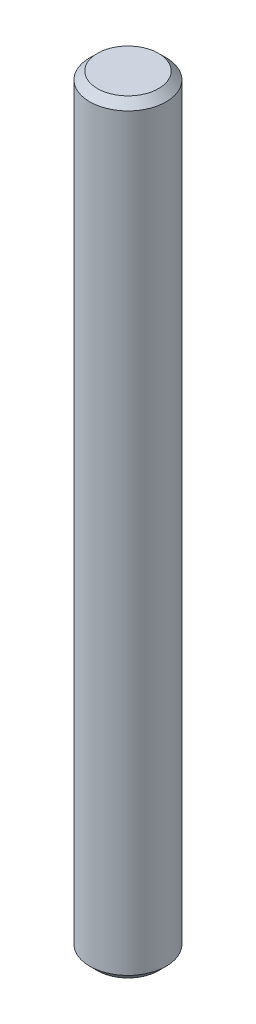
ISO-10303-21;
HEADER;
FILE_DESCRIPTION(('STEP AP214'),'2;1');
FILE_NAME('part.step','',(''),(''),'','','');
FILE_SCHEMA(('AUTOMOTIVE_DESIGN { 1 0 10303 214 1 1 1 1 }'));
ENDSEC;
DATA;
#1=APPLICATION_CONTEXT('core data for automotive mechanical design processes');
#2=APPLICATION_PROTOCOL_DEFINITION('international standard','automotive_design',2000,#1);
#3=PRODUCT_CONTEXT('',#1,'mechanical');
#4=PRODUCT('Part','Part','',(#3));
#5=PRODUCT_RELATED_PRODUCT_CATEGORY('part','',(#4));
#6=PRODUCT_DEFINITION_FORMATION('','',#4);
#7=PRODUCT_DEFINITION_CONTEXT('part definition',#1,'design');
#8=PRODUCT_DEFINITION('design','',#6,#7);
#9=PRODUCT_DEFINITION_SHAPE('','',#8);
#10=(LENGTH_UNIT() NAMED_UNIT(*) SI_UNIT(.MILLI.,.METRE.));
#11=(NAMED_UNIT(*) PLANE_ANGLE_UNIT() SI_UNIT($,.RADIAN.));
#12=(NAMED_UNIT(*) SI_UNIT($,.STERADIAN.) SOLID_ANGLE_UNIT());
#13=UNCERTAINTY_MEASURE_WITH_UNIT(LENGTH_MEASURE(1.E-05),#10,'distance_accuracy_value','');
#14=(GEOMETRIC_REPRESENTATION_CONTEXT(3) GLOBAL_UNCERTAINTY_ASSIGNED_CONTEXT((#13)) GLOBAL_UNIT_ASSIGNED_CONTEXT((#10,
#11,#12)) REPRESENTATION_CONTEXT('',''));
#15=CARTESIAN_POINT('',(0.,0.,0.));
#16=DIRECTION('',(0.,0.,1.));
#17=DIRECTION('',(1.,0.,0.));
#18=AXIS2_PLACEMENT_3D('',#15,#16,#17);
#19=CARTESIAN_POINT('',(0.,40.,0.));
#20=DIRECTION('',(0.,-1.,0.));
#21=DIRECTION('',(0.,0.,-1.));
#22=AXIS2_PLACEMENT_3D('',#19,#20,#21);
#23=CYLINDRICAL_SURFACE('',#22,2.);
#24=CARTESIAN_POINT('',(0.,0.400000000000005,0.));
#25=DIRECTION('',(0.,1.,0.));
#26=DIRECTION('',(0.,0.,1.));
#27=AXIS2_PLACEMENT_3D('',#24,#25,#26);
#28=CIRCLE('',#27,2.);
#29=CARTESIAN_POINT('',(0.,0.400000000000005,2.));
#30=VERTEX_POINT('',#29);
#31=EDGE_CURVE('E43',#30,#30,#28,.T.);
#32=ORIENTED_EDGE('',*,*,#31,.T.);
#33=EDGE_LOOP('',(#32));
#34=FACE_BOUND('',#33,.T.);
#35=CARTESIAN_POINT('',(0.,39.6,0.));
#36=DIRECTION('',(0.,1.,0.));
#37=DIRECTION('',(0.,0.,1.));
#38=AXIS2_PLACEMENT_3D('',#35,#36,#37);
#39=CIRCLE('',#38,2.);
#40=CARTESIAN_POINT('',(0.,39.6,2.));
#41=VERTEX_POINT('',#40);
#42=EDGE_CURVE('E47',#41,#41,#39,.F.);
#43=ORIENTED_EDGE('',*,*,#42,.T.);
#44=EDGE_LOOP('',(#43));
#45=FACE_BOUND('',#44,.T.);
#46=ADVANCED_FACE('F32',(#34,#45),#23,.T.);
#47=CARTESIAN_POINT('',(0.,40.,0.));
#48=DIRECTION('',(0.,1.,0.));
#49=DIRECTION('',(0.,0.,1.));
#50=AXIS2_PLACEMENT_3D('',#47,#48,#49);
#51=PLANE('',#50);
#52=CARTESIAN_POINT('',(0.,40.,0.));
#53=DIRECTION('',(0.,1.,0.));
#54=DIRECTION('',(0.,0.,1.));
#55=AXIS2_PLACEMENT_3D('',#52,#53,#54);
#56=CIRCLE('',#55,1.6);
#57=CARTESIAN_POINT('',(0.,40.,1.6));
#58=VERTEX_POINT('',#57);
#59=EDGE_CURVE('E10',#58,#58,#56,.T.);
#60=ORIENTED_EDGE('',*,*,#59,.T.);
#61=EDGE_LOOP('',(#60));
#62=FACE_BOUND('',#61,.T.);
#63=ADVANCED_FACE('F63',(#62),#51,.T.);
#64=CARTESIAN_POINT('',(0.,0.,0.));
#65=DIRECTION('',(0.,1.,0.));
#66=DIRECTION('',(0.,0.,1.));
#67=AXIS2_PLACEMENT_3D('',#64,#65,#66);
#68=PLANE('',#67);
#69=CARTESIAN_POINT('',(0.,0.,0.));
#70=DIRECTION('',(0.,1.,0.));
#71=DIRECTION('',(0.,0.,1.));
#72=AXIS2_PLACEMENT_3D('',#69,#70,#71);
#73=CIRCLE('',#72,1.59999999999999);
#74=CARTESIAN_POINT('',(0.,0.,1.59999999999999));
#75=VERTEX_POINT('',#74);
#76=EDGE_CURVE('E39',#75,#75,#73,.F.);
#77=ORIENTED_EDGE('',*,*,#76,.T.);
#78=EDGE_LOOP('',(#77));
#79=FACE_BOUND('',#78,.T.);
#80=ADVANCED_FACE('F60',(#79),#68,.F.);
#81=CARTESIAN_POINT('',(0.,0.400000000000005,0.));
#82=DIRECTION('',(0.,1.,0.));
#83=DIRECTION('',(0.,0.,1.));
#84=AXIS2_PLACEMENT_3D('',#81,#82,#83);
#85=CONICAL_SURFACE('',#84,2.,0.78539816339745);
#86=ORIENTED_EDGE('',*,*,#76,.F.);
#87=EDGE_LOOP('',(#86));
#88=FACE_BOUND('',#87,.T.);
#89=ORIENTED_EDGE('',*,*,#31,.F.);
#90=EDGE_LOOP('',(#89));
#91=FACE_BOUND('',#90,.T.);
#92=ADVANCED_FACE('F56',(#88,#91),#85,.T.);
#93=CARTESIAN_POINT('',(0.,40.,0.));
#94=DIRECTION('',(0.,-1.,0.));
#95=DIRECTION('',(0.,0.,-1.));
#96=AXIS2_PLACEMENT_3D('',#93,#94,#95);
#97=CONICAL_SURFACE('',#96,1.6,0.785398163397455);
#98=ORIENTED_EDGE('',*,*,#42,.F.);
#99=EDGE_LOOP('',(#98));
#100=FACE_BOUND('',#99,.T.);
#101=ORIENTED_EDGE('',*,*,#59,.F.);
#102=EDGE_LOOP('',(#101));
#103=FACE_BOUND('',#102,.T.);
#104=ADVANCED_FACE('F34',(#100,#103),#97,.T.);
#105=CLOSED_SHELL('',(#46,#63,#80,#92,#104));
#106=MANIFOLD_SOLID_BREP('B2',#105);
#107=ADVANCED_BREP_SHAPE_REPRESENTATION('',(#18,#106),#14);
#108=SHAPE_DEFINITION_REPRESENTATION(#9,#107);
ENDSEC;
END-ISO-10303-21;
